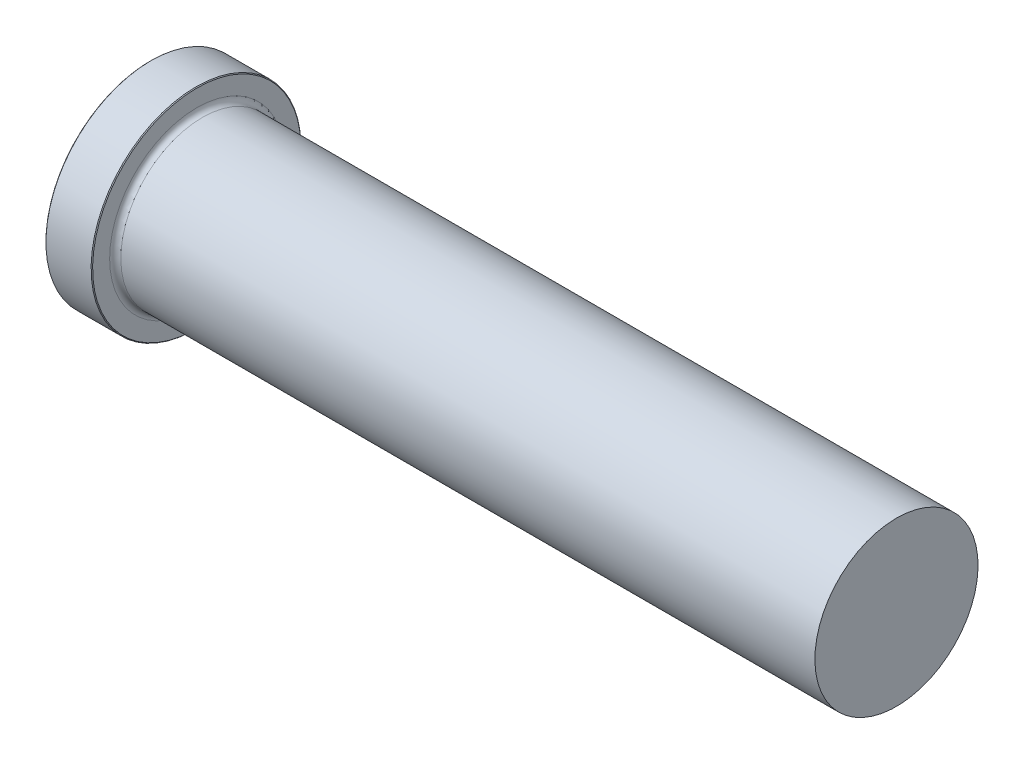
from build123d import *

# Parameters (mm, degrees)
CHAMFER1_SIZE = 0.1016


with BuildPart() as part:
    # Sketch1 → Revolve1 (revolve)
    with BuildSketch(Plane.XY):
        with BuildLine():
            Line((0, 0), (0, 14.2875))
            Line((0, 14.2875), (6.35, 14.2875))
            Line((6.35, 14.2875), (6.35, 11.86815))
            ThreePointArc((6.35, 11.86815), (6.573184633, 11.329334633), (7.112, 11.10615))
            Line((7.112, 11.10615), (101.6, 11.10615))
            Line((101.6, 11.10615), (101.6, 0))
            Line((101.6, 0), (0, 0))
        make_face()
    revolve(axis=Axis((101.6, 0, 0), (-1, 0, 0)))

    # Chamfer1
    chamfer1_edges = [part.edges().sort_by_distance(p)[0] for p in [
        (0, -14.2875, 0),
        (6.35, -14.2875, 0),
    ]]
    chamfer(chamfer1_edges, length=CHAMFER1_SIZE)


solid = part.part
